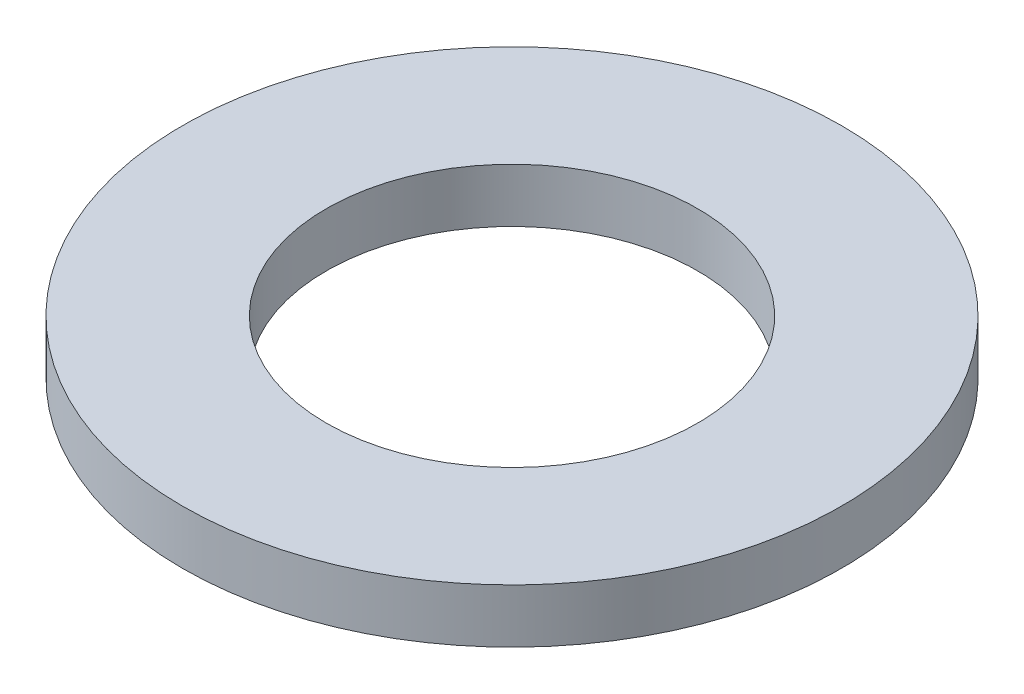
ISO-10303-21;
HEADER;
FILE_DESCRIPTION(('STEP AP214'),'2;1');
FILE_NAME('part.step','',(''),(''),'','','');
FILE_SCHEMA(('AUTOMOTIVE_DESIGN { 1 0 10303 214 1 1 1 1 }'));
ENDSEC;
DATA;
#1=APPLICATION_CONTEXT('core data for automotive mechanical design processes');
#2=APPLICATION_PROTOCOL_DEFINITION('international standard','automotive_design',2000,#1);
#3=PRODUCT_CONTEXT('',#1,'mechanical');
#4=PRODUCT('Part','Part','',(#3));
#5=PRODUCT_RELATED_PRODUCT_CATEGORY('part','',(#4));
#6=PRODUCT_DEFINITION_FORMATION('','',#4);
#7=PRODUCT_DEFINITION_CONTEXT('part definition',#1,'design');
#8=PRODUCT_DEFINITION('design','',#6,#7);
#9=PRODUCT_DEFINITION_SHAPE('','',#8);
#10=(LENGTH_UNIT() NAMED_UNIT(*) SI_UNIT(.MILLI.,.METRE.));
#11=(NAMED_UNIT(*) PLANE_ANGLE_UNIT() SI_UNIT($,.RADIAN.));
#12=(NAMED_UNIT(*) SI_UNIT($,.STERADIAN.) SOLID_ANGLE_UNIT());
#13=UNCERTAINTY_MEASURE_WITH_UNIT(LENGTH_MEASURE(1.E-05),#10,'distance_accuracy_value','');
#14=(GEOMETRIC_REPRESENTATION_CONTEXT(3) GLOBAL_UNCERTAINTY_ASSIGNED_CONTEXT((#13)) GLOBAL_UNIT_ASSIGNED_CONTEXT((#10,
#11,#12)) REPRESENTATION_CONTEXT('',''));
#15=CARTESIAN_POINT('',(0.,0.,0.));
#16=DIRECTION('',(0.,0.,1.));
#17=DIRECTION('',(1.,0.,0.));
#18=AXIS2_PLACEMENT_3D('',#15,#16,#17);
#19=CARTESIAN_POINT('',(0.,9.,0.));
#20=DIRECTION('',(0.,1.,0.));
#21=DIRECTION('',(0.,0.,1.));
#22=AXIS2_PLACEMENT_3D('',#19,#20,#21);
#23=PLANE('',#22);
#24=CARTESIAN_POINT('',(0.,9.,0.));
#25=DIRECTION('',(0.,1.,0.));
#26=DIRECTION('',(0.,0.,1.));
#27=AXIS2_PLACEMENT_3D('',#24,#25,#26);
#28=CIRCLE('',#27,55.);
#29=CARTESIAN_POINT('',(0.,9.,55.));
#30=VERTEX_POINT('',#29);
#31=EDGE_CURVE('E10',#30,#30,#28,.T.);
#32=ORIENTED_EDGE('',*,*,#31,.T.);
#33=EDGE_LOOP('',(#32));
#34=FACE_BOUND('',#33,.T.);
#35=CARTESIAN_POINT('',(0.,9.,0.));
#36=DIRECTION('',(0.,1.,0.));
#37=DIRECTION('',(0.,0.,1.));
#38=AXIS2_PLACEMENT_3D('',#35,#36,#37);
#39=CIRCLE('',#38,31.);
#40=CARTESIAN_POINT('',(0.,9.,31.));
#41=VERTEX_POINT('',#40);
#42=EDGE_CURVE('E39',#41,#41,#39,.T.);
#43=ORIENTED_EDGE('',*,*,#42,.F.);
#44=EDGE_LOOP('',(#43));
#45=FACE_BOUND('',#44,.T.);
#46=ADVANCED_FACE('F28',(#34,#45),#23,.T.);
#47=CARTESIAN_POINT('',(0.,0.,0.));
#48=DIRECTION('',(0.,1.,0.));
#49=DIRECTION('',(0.,0.,1.));
#50=AXIS2_PLACEMENT_3D('',#47,#48,#49);
#51=PLANE('',#50);
#52=CARTESIAN_POINT('',(0.,0.,0.));
#53=DIRECTION('',(0.,1.,0.));
#54=DIRECTION('',(0.,0.,1.));
#55=AXIS2_PLACEMENT_3D('',#52,#53,#54);
#56=CIRCLE('',#55,55.);
#57=CARTESIAN_POINT('',(0.,0.,55.));
#58=VERTEX_POINT('',#57);
#59=EDGE_CURVE('E35',#58,#58,#56,.T.);
#60=ORIENTED_EDGE('',*,*,#59,.F.);
#61=EDGE_LOOP('',(#60));
#62=FACE_BOUND('',#61,.T.);
#63=CARTESIAN_POINT('',(0.,0.,0.));
#64=DIRECTION('',(0.,1.,0.));
#65=DIRECTION('',(0.,0.,1.));
#66=AXIS2_PLACEMENT_3D('',#63,#64,#65);
#67=CIRCLE('',#66,31.);
#68=CARTESIAN_POINT('',(0.,0.,31.));
#69=VERTEX_POINT('',#68);
#70=EDGE_CURVE('E43',#69,#69,#67,.T.);
#71=ORIENTED_EDGE('',*,*,#70,.T.);
#72=EDGE_LOOP('',(#71));
#73=FACE_BOUND('',#72,.T.);
#74=ADVANCED_FACE('F49',(#62,#73),#51,.F.);
#75=CARTESIAN_POINT('',(0.,9.,0.));
#76=DIRECTION('',(0.,-1.,0.));
#77=DIRECTION('',(0.,0.,-1.));
#78=AXIS2_PLACEMENT_3D('',#75,#76,#77);
#79=CYLINDRICAL_SURFACE('',#78,55.);
#80=ORIENTED_EDGE('',*,*,#31,.F.);
#81=EDGE_LOOP('',(#80));
#82=FACE_BOUND('',#81,.T.);
#83=ORIENTED_EDGE('',*,*,#59,.T.);
#84=EDGE_LOOP('',(#83));
#85=FACE_BOUND('',#84,.T.);
#86=ADVANCED_FACE('F30',(#82,#85),#79,.T.);
#87=CARTESIAN_POINT('',(0.,9.,0.));
#88=DIRECTION('',(0.,-1.,0.));
#89=DIRECTION('',(0.,0.,-1.));
#90=AXIS2_PLACEMENT_3D('',#87,#88,#89);
#91=CYLINDRICAL_SURFACE('',#90,31.);
#92=ORIENTED_EDGE('',*,*,#42,.T.);
#93=EDGE_LOOP('',(#92));
#94=FACE_BOUND('',#93,.T.);
#95=ORIENTED_EDGE('',*,*,#70,.F.);
#96=EDGE_LOOP('',(#95));
#97=FACE_BOUND('',#96,.T.);
#98=ADVANCED_FACE('F51',(#94,#97),#91,.F.);
#99=CLOSED_SHELL('',(#46,#74,#86,#98));
#100=MANIFOLD_SOLID_BREP('B2',#99);
#101=ADVANCED_BREP_SHAPE_REPRESENTATION('',(#18,#100),#14);
#102=SHAPE_DEFINITION_REPRESENTATION(#9,#101);
ENDSEC;
END-ISO-10303-21;
